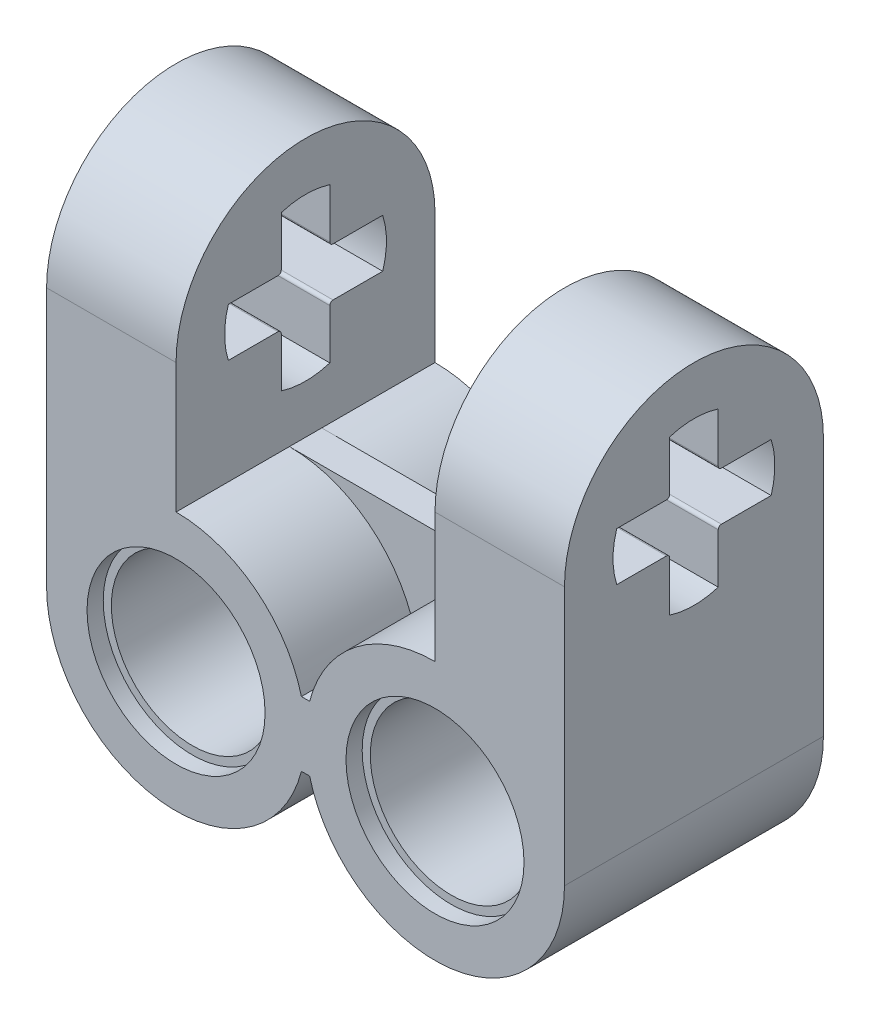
from build123d import *

# Parameters (mm, degrees)
EXTRUIR1_DEPTH            = 4
CORTAR_EXTRUIR4_DEPTH     = 4
EXTRUIR2_DEPTH            = 0.5
EXTRUIR3_DEPTH            = 4
CROQUIS8_R                = 2.5
CORTAR_EXTRUIR5_DEPTH     = 20.595917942
CROQUIS9_R                = 2.75
CORTAR_EXTRUIR6_DEPTH     = 0.5
SIMETR_A5_COPY_1_SKETCH_R = 2.75
SIMETR_A5_COPY_1_DEPTH    = 0.5


with BuildPart() as part:
    # Croquis1 → Extruir1 (new, symmetric)
    with BuildSketch(Plane.XY):
        with BuildLine():
            Line((-4, 8), (4, 8))
            ThreePointArc((4, 8), (8, 4), (4, 0))
            Line((4, 0), (-4, 0))
            ThreePointArc((-4, 0), (-8, 4), (-4, 8))
        make_face()
    extrude(amount=EXTRUIR1_DEPTH, both=True)

    # Croquis4 → Cortar-Extruir4 (cut, symmetric)
    with BuildSketch(Plane.XY):
        with BuildLine():
            Line((-0.127016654, 5), (0.127016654, 5))
            ThreePointArc((0.127016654, 5), (1.550510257, 7.16227766), (4, 8))
            Line((4, 8), (-4, 8))
            ThreePointArc((-4, 8), (-1.550510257, 7.16227766), (-0.127016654, 5))
        make_face()
        with BuildLine():
            Line((-4, 0), (4, 0))
            ThreePointArc((4, 0), (1.550510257, 0.83772234), (0.127016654, 3))
            Line((0.127016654, 3), (-0.127016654, 3))
            ThreePointArc((-0.127016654, 3), (-1.550510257, 0.83772234), (-4, 0))
        make_face()
    extrude(amount=CORTAR_EXTRUIR4_DEPTH, both=True, mode=Mode.SUBTRACT)

    # Croquis5 → Extruir2 (add, symmetric)
    with BuildSketch(Plane.XY):
        with BuildLine():
            Line((-4, 8), (4, 8))
            ThreePointArc((4, 8), (1.550510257, 7.16227766), (0.127016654, 5))
            Line((0.127016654, 5), (-0.127016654, 5))
            ThreePointArc((-0.127016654, 5), (-1.550510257, 7.16227766), (-4, 8))
        make_face()
    extruir2 = extrude(amount=EXTRUIR2_DEPTH, both=True)

    # Simetr_a2: Extruir2 across plane
    add(extruir2.mirror(Plane.ZX.offset(4)))

    # Croquis7 → Extruir3 (add)
    with BuildSketch(Plane(origin=(8, 0, 0), x_dir=(0, 0, -1), z_dir=(1, 0, 0))):
        with BuildLine():
            Line((-4, 4), (-4, 12))
            ThreePointArc((-4, 12), (0, 16), (4, 12))
            Line((4, 12), (4, 4))
            Line((4, 4), (-4, 4))
        make_face()
        with BuildLine():
            Line((0.75, 14.384848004), (0.75, 12.85))
            ThreePointArc((0.75, 12.85), (0.779289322, 12.779289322), (0.85, 12.75))
            Line((0.85, 12.75), (2.384848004, 12.75))
            ThreePointArc((2.384848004, 12.75), (2.5, 12), (2.384848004, 11.25))
            Line((2.384848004, 11.25), (0.85, 11.25))
            ThreePointArc((0.85, 11.25), (0.779289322, 11.220710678), (0.75, 11.15))
            Line((0.75, 11.15), (0.75, 9.615151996))
            ThreePointArc((0.75, 9.615151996), (0, 9.5), (-0.75, 9.615151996))
            Line((-0.75, 9.615151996), (-0.75, 11.15))
            ThreePointArc((-0.75, 11.15), (-0.779289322, 11.220710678), (-0.85, 11.25))
            Line((-0.85, 11.25), (-2.384848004, 11.25))
            ThreePointArc((-2.384848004, 11.25), (-2.5, 12), (-2.384848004, 12.75))
            Line((-2.384848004, 12.75), (-0.85, 12.75))
            ThreePointArc((-0.85, 12.75), (-0.779289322, 12.779289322), (-0.75, 12.85))
            Line((-0.75, 12.85), (-0.75, 14.384848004))
            ThreePointArc((-0.75, 14.384848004), (0, 14.5), (0.75, 14.384848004))
        make_face(mode=Mode.SUBTRACT)
    extruir3 = extrude(amount=-EXTRUIR3_DEPTH)

    # Simetr_a3: Extruir3 across plane
    add(extruir3.mirror(Plane(origin=(0, 0, 0), x_dir=(0, 0, 1), z_dir=(1, 0, 0))))

    # Croquis8 → Cortar-Extruir5 (cut, through all)
    with BuildSketch(Plane.XY.offset(4)):
        with Locations((-4, 4)):
            Circle(CROQUIS8_R)
    cortar_extruir5 = extrude(amount=-CORTAR_EXTRUIR5_DEPTH, mode=Mode.SUBTRACT)

    # Croquis9 → Cortar-Extruir6 (cut)
    with BuildSketch(Plane.XY.offset(4)):
        with Locations((-4, 4)):
            Circle(CROQUIS9_R)
    cortar_extruir6 = extrude(amount=-CORTAR_EXTRUIR6_DEPTH, mode=Mode.SUBTRACT)

    # Simetr_a4: Cortar-Extruir6 across plane
    add(cortar_extruir6.mirror(Plane(origin=(0, 0, 0), x_dir=(0, 0, 1), z_dir=(1, 0, 0))), mode=Mode.SUBTRACT)

    # Simetr_a5: Cortar-Extruir6 across plane
    add(cortar_extruir6.mirror(Plane.XY), mode=Mode.SUBTRACT)

    # Simetr_a5 copy 1 sketch → Simetr_a5 copy 1 (cut)
    with BuildSketch(Plane(origin=(0, 0, -4), x_dir=(-1, 0, 0), z_dir=(0, 0, -1))):
        with Locations((-4, 4)):
            Circle(SIMETR_A5_COPY_1_SKETCH_R)
    extrude(amount=-SIMETR_A5_COPY_1_DEPTH, mode=Mode.SUBTRACT)

    # Simetr_a6: Cortar-Extruir5 across plane
    add(cortar_extruir5.mirror(Plane(origin=(0, 0, 0), x_dir=(0, 0, 1), z_dir=(1, 0, 0))), mode=Mode.SUBTRACT)


solid = part.part
